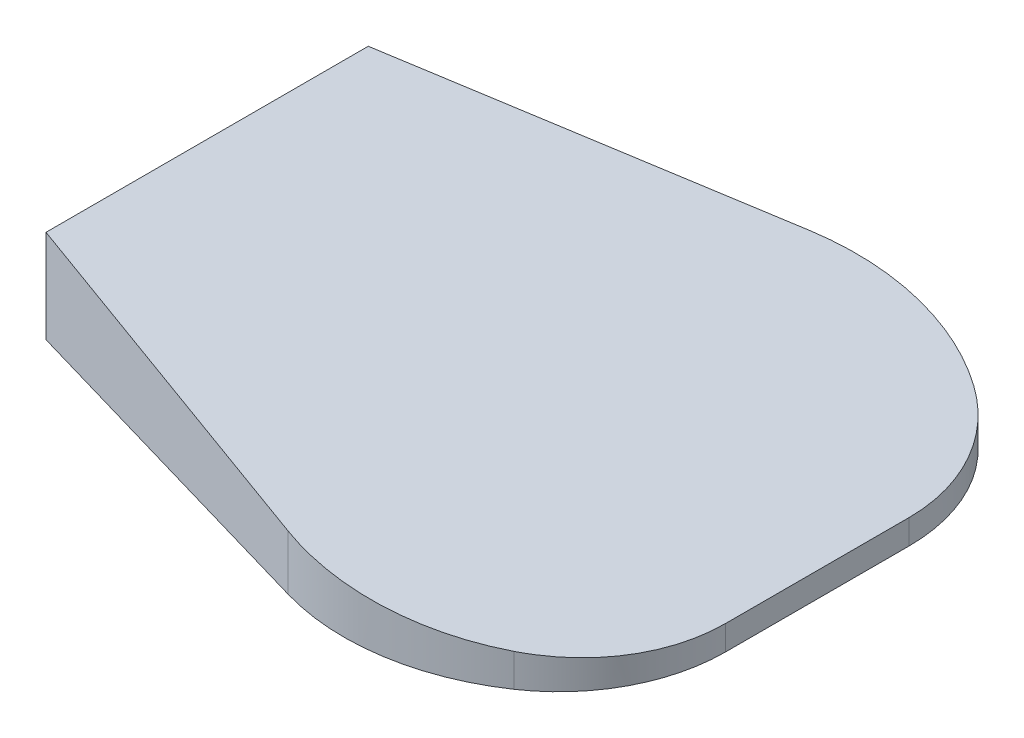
from build123d import *

# Parameters (mm, degrees)
EXTRUDE1_DEPTH          = 71
CUT_EXTRUDE1_DEPTH      = 397.502541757
CUT_EXTRUDE1_DEPTH_BACK = 397.502541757


with BuildPart() as part:
    # Sketch1 → Extrude1 (new body)
    with BuildSketch(Plane(origin=(0, 0, 0), x_dir=(-1, 0, 0), z_dir=(0, 1, 0))):
        with BuildLine():
            Line((25.651998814, -50.33472093), (25.651998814, 50.33472093))
            ThreePointArc((25.651998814, 50.33472093), (36.367493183, 93.34997219), (66.009571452, 126.311781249))
            ThreePointArc((66.009571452, 126.311781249), (117.721599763, 146.660166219), (173.17997316, 143.116232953))
            Line((173.17997316, 143.116232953), (360.845611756, 88.508214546))
            Line((360.845611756, 88.508214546), (360.845611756, -88.508214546))
            Line((360.845611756, -88.508214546), (173.17997316, -143.116232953))
            ThreePointArc((173.17997316, -143.116232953), (117.721599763, -146.660166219), (66.009571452, -126.311781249))
            ThreePointArc((66.009571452, -126.311781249), (36.367493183, -93.34997219), (25.651998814, -50.33472093))
        make_face()
    extrude(amount=EXTRUDE1_DEPTH)

    # Sketch2 → Cut-Extrude1 (cut, two sides: drawn at the far end of the back side and taken through both)
    with BuildSketch(Plane.XY.offset(-CUT_EXTRUDE1_DEPTH_BACK)):
        Polygon((838.36993129, -83.276246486), (-15.675195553, 12.427298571), (-445.994558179, 60.648507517), (-1300.039685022, 156.352052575), (-1108.632594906, 1864.442306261), (1029.777021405, 1624.814007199), align=None)
    extrude(amount=CUT_EXTRUDE1_DEPTH + CUT_EXTRUDE1_DEPTH_BACK, mode=Mode.SUBTRACT)


solid = part.part
